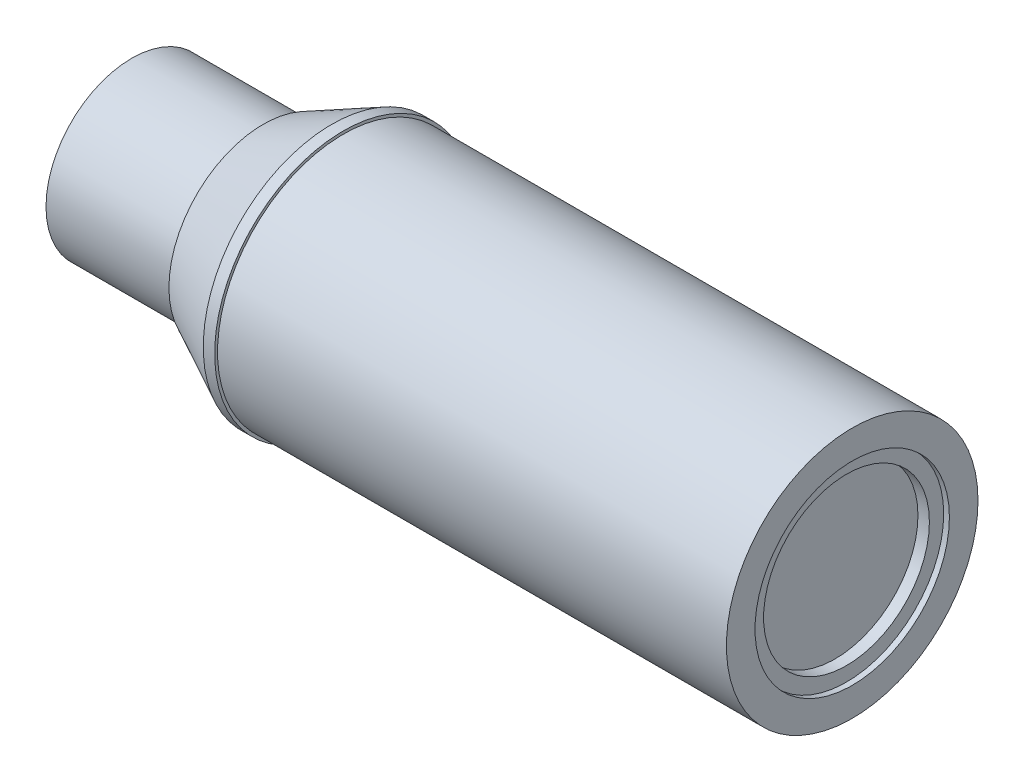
ISO-10303-21;
HEADER;
FILE_DESCRIPTION(('STEP AP214'),'2;1');
FILE_NAME('part.step','',(''),(''),'','','');
FILE_SCHEMA(('AUTOMOTIVE_DESIGN { 1 0 10303 214 1 1 1 1 }'));
ENDSEC;
DATA;
#1=APPLICATION_CONTEXT('core data for automotive mechanical design processes');
#2=APPLICATION_PROTOCOL_DEFINITION('international standard','automotive_design',2000,#1);
#3=PRODUCT_CONTEXT('',#1,'mechanical');
#4=PRODUCT('Part','Part','',(#3));
#5=PRODUCT_RELATED_PRODUCT_CATEGORY('part','',(#4));
#6=PRODUCT_DEFINITION_FORMATION('','',#4);
#7=PRODUCT_DEFINITION_CONTEXT('part definition',#1,'design');
#8=PRODUCT_DEFINITION('design','',#6,#7);
#9=PRODUCT_DEFINITION_SHAPE('','',#8);
#10=(LENGTH_UNIT() NAMED_UNIT(*) SI_UNIT(.MILLI.,.METRE.));
#11=(NAMED_UNIT(*) PLANE_ANGLE_UNIT() SI_UNIT($,.RADIAN.));
#12=(NAMED_UNIT(*) SI_UNIT($,.STERADIAN.) SOLID_ANGLE_UNIT());
#13=UNCERTAINTY_MEASURE_WITH_UNIT(LENGTH_MEASURE(1.E-05),#10,'distance_accuracy_value','');
#14=(GEOMETRIC_REPRESENTATION_CONTEXT(3) GLOBAL_UNCERTAINTY_ASSIGNED_CONTEXT((#13)) GLOBAL_UNIT_ASSIGNED_CONTEXT((#10,
#11,#12)) REPRESENTATION_CONTEXT('',''));
#15=CARTESIAN_POINT('',(0.,0.,0.));
#16=DIRECTION('',(0.,0.,1.));
#17=DIRECTION('',(1.,0.,0.));
#18=AXIS2_PLACEMENT_3D('',#15,#16,#17);
#19=CARTESIAN_POINT('',(23.,0.,0.));
#20=DIRECTION('',(-1.,0.,0.));
#21=DIRECTION('',(0.,0.,1.));
#22=AXIS2_PLACEMENT_3D('',#19,#20,#21);
#23=CYLINDRICAL_SURFACE('',#22,15.);
#24=CARTESIAN_POINT('',(23.,0.,0.));
#25=DIRECTION('',(1.,0.,0.));
#26=DIRECTION('',(0.,0.,-1.));
#27=AXIS2_PLACEMENT_3D('',#24,#25,#26);
#28=CIRCLE('',#27,15.);
#29=CARTESIAN_POINT('',(23.,0.,-15.));
#30=VERTEX_POINT('',#29);
#31=EDGE_CURVE('E48',#30,#30,#28,.T.);
#32=ORIENTED_EDGE('',*,*,#31,.F.);
#33=EDGE_LOOP('',(#32));
#34=FACE_BOUND('',#33,.T.);
#35=CARTESIAN_POINT('',(0.,0.,0.));
#36=DIRECTION('',(1.,0.,0.));
#37=DIRECTION('',(0.,0.,-1.));
#38=AXIS2_PLACEMENT_3D('',#35,#36,#37);
#39=CIRCLE('',#38,15.);
#40=CARTESIAN_POINT('',(0.,0.,-15.));
#41=VERTEX_POINT('',#40);
#42=EDGE_CURVE('E53',#41,#41,#39,.T.);
#43=ORIENTED_EDGE('',*,*,#42,.T.);
#44=EDGE_LOOP('',(#43));
#45=FACE_BOUND('',#44,.T.);
#46=ADVANCED_FACE('F40',(#34,#45),#23,.T.);
#47=CARTESIAN_POINT('',(0.,0.,0.));
#48=DIRECTION('',(1.,0.,0.));
#49=DIRECTION('',(0.,0.,-1.));
#50=AXIS2_PLACEMENT_3D('',#47,#48,#49);
#51=PLANE('',#50);
#52=ORIENTED_EDGE('',*,*,#42,.F.);
#53=EDGE_LOOP('',(#52));
#54=FACE_BOUND('',#53,.T.);
#55=ADVANCED_FACE('F84',(#54),#51,.F.);
#56=CARTESIAN_POINT('',(23.,0.,0.));
#57=DIRECTION('',(1.,0.,0.));
#58=DIRECTION('',(0.,0.,-1.));
#59=AXIS2_PLACEMENT_3D('',#56,#57,#58);
#60=PLANE('',#59);
#61=ORIENTED_EDGE('',*,*,#31,.T.);
#62=EDGE_LOOP('',(#61));
#63=FACE_BOUND('',#62,.T.);
#64=CARTESIAN_POINT('',(23.,0.,0.));
#65=DIRECTION('',(1.,0.,0.));
#66=DIRECTION('',(0.,0.,-1.));
#67=AXIS2_PLACEMENT_3D('',#64,#65,#66);
#68=CIRCLE('',#67,16.5);
#69=CARTESIAN_POINT('',(23.,0.,-16.5));
#70=VERTEX_POINT('',#69);
#71=EDGE_CURVE('E62',#70,#70,#68,.T.);
#72=ORIENTED_EDGE('',*,*,#71,.F.);
#73=EDGE_LOOP('',(#72));
#74=FACE_BOUND('',#73,.T.);
#75=ADVANCED_FACE('F81',(#63,#74),#60,.F.);
#76=CARTESIAN_POINT('',(23.,0.,0.));
#77=DIRECTION('',(1.,0.,0.));
#78=DIRECTION('',(0.,0.,-1.));
#79=AXIS2_PLACEMENT_3D('',#76,#77,#78);
#80=CONICAL_SURFACE('',#79,16.5,0.463647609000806);
#81=ORIENTED_EDGE('',*,*,#71,.T.);
#82=EDGE_LOOP('',(#81));
#83=FACE_BOUND('',#82,.T.);
#84=CARTESIAN_POINT('',(35.,0.,0.));
#85=DIRECTION('',(1.,0.,0.));
#86=DIRECTION('',(0.,0.,-1.));
#87=AXIS2_PLACEMENT_3D('',#84,#85,#86);
#88=CIRCLE('',#87,22.5);
#89=CARTESIAN_POINT('',(35.,0.,-22.5));
#90=VERTEX_POINT('',#89);
#91=EDGE_CURVE('E43',#90,#90,#88,.T.);
#92=ORIENTED_EDGE('',*,*,#91,.F.);
#93=EDGE_LOOP('',(#92));
#94=FACE_BOUND('',#93,.T.);
#95=ADVANCED_FACE('F71',(#83,#94),#80,.T.);
#96=CARTESIAN_POINT('',(37.,0.,0.));
#97=DIRECTION('',(-1.,0.,0.));
#98=DIRECTION('',(0.,0.,1.));
#99=AXIS2_PLACEMENT_3D('',#96,#97,#98);
#100=CYLINDRICAL_SURFACE('',#99,22.5);
#101=CARTESIAN_POINT('',(37.,0.,0.));
#102=DIRECTION('',(1.,0.,0.));
#103=DIRECTION('',(0.,0.,-1.));
#104=AXIS2_PLACEMENT_3D('',#101,#102,#103);
#105=CIRCLE('',#104,22.5);
#106=CARTESIAN_POINT('',(37.,0.,-22.5));
#107=VERTEX_POINT('',#106);
#108=EDGE_CURVE('E59',#107,#107,#105,.T.);
#109=ORIENTED_EDGE('',*,*,#108,.F.);
#110=EDGE_LOOP('',(#109));
#111=FACE_BOUND('',#110,.T.);
#112=ORIENTED_EDGE('',*,*,#91,.T.);
#113=EDGE_LOOP('',(#112));
#114=FACE_BOUND('',#113,.T.);
#115=ADVANCED_FACE('F80',(#111,#114),#100,.T.);
#116=CARTESIAN_POINT('',(37.,0.,0.));
#117=DIRECTION('',(1.,0.,0.));
#118=DIRECTION('',(0.,0.,-1.));
#119=AXIS2_PLACEMENT_3D('',#116,#117,#118);
#120=PLANE('',#119);
#121=CARTESIAN_POINT('',(37.,0.,0.));
#122=DIRECTION('',(1.,0.,0.));
#123=DIRECTION('',(0.,0.,-1.));
#124=AXIS2_PLACEMENT_3D('',#121,#122,#123);
#125=CIRCLE('',#124,22.);
#126=CARTESIAN_POINT('',(37.,0.,-22.));
#127=VERTEX_POINT('',#126);
#128=EDGE_CURVE('E11',#127,#127,#125,.T.);
#129=ORIENTED_EDGE('',*,*,#128,.F.);
#130=EDGE_LOOP('',(#129));
#131=FACE_BOUND('',#130,.T.);
#132=ORIENTED_EDGE('',*,*,#108,.T.);
#133=EDGE_LOOP('',(#132));
#134=FACE_BOUND('',#133,.T.);
#135=ADVANCED_FACE('F109',(#131,#134),#120,.T.);
#136=CARTESIAN_POINT('',(126.,0.,0.));
#137=DIRECTION('',(-1.,0.,0.));
#138=DIRECTION('',(0.,0.,1.));
#139=AXIS2_PLACEMENT_3D('',#136,#137,#138);
#140=CYLINDRICAL_SURFACE('',#139,22.);
#141=CARTESIAN_POINT('',(126.,0.,0.));
#142=DIRECTION('',(1.,0.,0.));
#143=DIRECTION('',(0.,0.,-1.));
#144=AXIS2_PLACEMENT_3D('',#141,#142,#143);
#145=CIRCLE('',#144,22.);
#146=CARTESIAN_POINT('',(126.,0.,-22.));
#147=VERTEX_POINT('',#146);
#148=EDGE_CURVE('E57',#147,#147,#145,.T.);
#149=ORIENTED_EDGE('',*,*,#148,.F.);
#150=EDGE_LOOP('',(#149));
#151=FACE_BOUND('',#150,.T.);
#152=ORIENTED_EDGE('',*,*,#128,.T.);
#153=EDGE_LOOP('',(#152));
#154=FACE_BOUND('',#153,.T.);
#155=ADVANCED_FACE('F113',(#151,#154),#140,.T.);
#156=CARTESIAN_POINT('',(126.,0.,0.));
#157=DIRECTION('',(1.,0.,0.));
#158=DIRECTION('',(0.,0.,-1.));
#159=AXIS2_PLACEMENT_3D('',#156,#157,#158);
#160=PLANE('',#159);
#161=CARTESIAN_POINT('',(126.,0.,0.));
#162=DIRECTION('',(1.,0.,0.));
#163=DIRECTION('',(0.,0.,-1.));
#164=AXIS2_PLACEMENT_3D('',#161,#162,#163);
#165=CIRCLE('',#164,17.);
#166=CARTESIAN_POINT('',(126.,0.,-17.));
#167=VERTEX_POINT('',#166);
#168=EDGE_CURVE('E142',#167,#167,#165,.T.);
#169=ORIENTED_EDGE('',*,*,#168,.F.);
#170=EDGE_LOOP('',(#169));
#171=FACE_BOUND('',#170,.T.);
#172=ORIENTED_EDGE('',*,*,#148,.T.);
#173=EDGE_LOOP('',(#172));
#174=FACE_BOUND('',#173,.T.);
#175=ADVANCED_FACE('F117',(#171,#174),#160,.T.);
#176=CARTESIAN_POINT('',(125.,0.,0.));
#177=DIRECTION('',(1.,0.,0.));
#178=DIRECTION('',(0.,0.,-1.));
#179=AXIS2_PLACEMENT_3D('',#176,#177,#178);
#180=CYLINDRICAL_SURFACE('',#179,17.);
#181=CARTESIAN_POINT('',(125.,0.,0.));
#182=DIRECTION('',(1.,0.,0.));
#183=DIRECTION('',(0.,0.,-1.));
#184=AXIS2_PLACEMENT_3D('',#181,#182,#183);
#185=CIRCLE('',#184,17.);
#186=CARTESIAN_POINT('',(125.,0.,-17.));
#187=VERTEX_POINT('',#186);
#188=EDGE_CURVE('E146',#187,#187,#185,.T.);
#189=ORIENTED_EDGE('',*,*,#188,.F.);
#190=EDGE_LOOP('',(#189));
#191=FACE_BOUND('',#190,.T.);
#192=ORIENTED_EDGE('',*,*,#168,.T.);
#193=EDGE_LOOP('',(#192));
#194=FACE_BOUND('',#193,.T.);
#195=ADVANCED_FACE('F121',(#191,#194),#180,.F.);
#196=CARTESIAN_POINT('',(125.,0.,0.));
#197=DIRECTION('',(1.,0.,0.));
#198=DIRECTION('',(0.,0.,-1.));
#199=AXIS2_PLACEMENT_3D('',#196,#197,#198);
#200=PLANE('',#199);
#201=CARTESIAN_POINT('',(125.,0.,0.));
#202=DIRECTION('',(1.,0.,0.));
#203=DIRECTION('',(0.,0.,-1.));
#204=AXIS2_PLACEMENT_3D('',#201,#202,#203);
#205=CIRCLE('',#204,14.5);
#206=CARTESIAN_POINT('',(125.,0.,-14.5));
#207=VERTEX_POINT('',#206);
#208=EDGE_CURVE('E143',#207,#207,#205,.T.);
#209=ORIENTED_EDGE('',*,*,#208,.F.);
#210=EDGE_LOOP('',(#209));
#211=FACE_BOUND('',#210,.T.);
#212=ORIENTED_EDGE('',*,*,#188,.T.);
#213=EDGE_LOOP('',(#212));
#214=FACE_BOUND('',#213,.T.);
#215=ADVANCED_FACE('F125',(#211,#214),#200,.T.);
#216=CARTESIAN_POINT('',(123.,0.,0.));
#217=DIRECTION('',(1.,0.,0.));
#218=DIRECTION('',(0.,0.,-1.));
#219=AXIS2_PLACEMENT_3D('',#216,#217,#218);
#220=CYLINDRICAL_SURFACE('',#219,14.5);
#221=CARTESIAN_POINT('',(123.,0.,0.));
#222=DIRECTION('',(1.,0.,0.));
#223=DIRECTION('',(0.,0.,-1.));
#224=AXIS2_PLACEMENT_3D('',#221,#222,#223);
#225=CIRCLE('',#224,14.5);
#226=CARTESIAN_POINT('',(123.,0.,-14.5));
#227=VERTEX_POINT('',#226);
#228=EDGE_CURVE('E141',#227,#227,#225,.T.);
#229=ORIENTED_EDGE('',*,*,#228,.F.);
#230=EDGE_LOOP('',(#229));
#231=FACE_BOUND('',#230,.T.);
#232=ORIENTED_EDGE('',*,*,#208,.T.);
#233=EDGE_LOOP('',(#232));
#234=FACE_BOUND('',#233,.T.);
#235=ADVANCED_FACE('F129',(#231,#234),#220,.F.);
#236=CARTESIAN_POINT('',(123.,0.,0.));
#237=DIRECTION('',(1.,0.,0.));
#238=DIRECTION('',(0.,0.,-1.));
#239=AXIS2_PLACEMENT_3D('',#236,#237,#238);
#240=PLANE('',#239);
#241=ORIENTED_EDGE('',*,*,#228,.T.);
#242=EDGE_LOOP('',(#241));
#243=FACE_BOUND('',#242,.T.);
#244=ADVANCED_FACE('F133',(#243),#240,.T.);
#245=CLOSED_SHELL('',(#46,#55,#75,#95,#115,#135,#155,#175,#195,#215,#235,#244));
#246=MANIFOLD_SOLID_BREP('B2',#245);
#247=ADVANCED_BREP_SHAPE_REPRESENTATION('',(#18,#246),#14);
#248=SHAPE_DEFINITION_REPRESENTATION(#9,#247);
ENDSEC;
END-ISO-10303-21;
